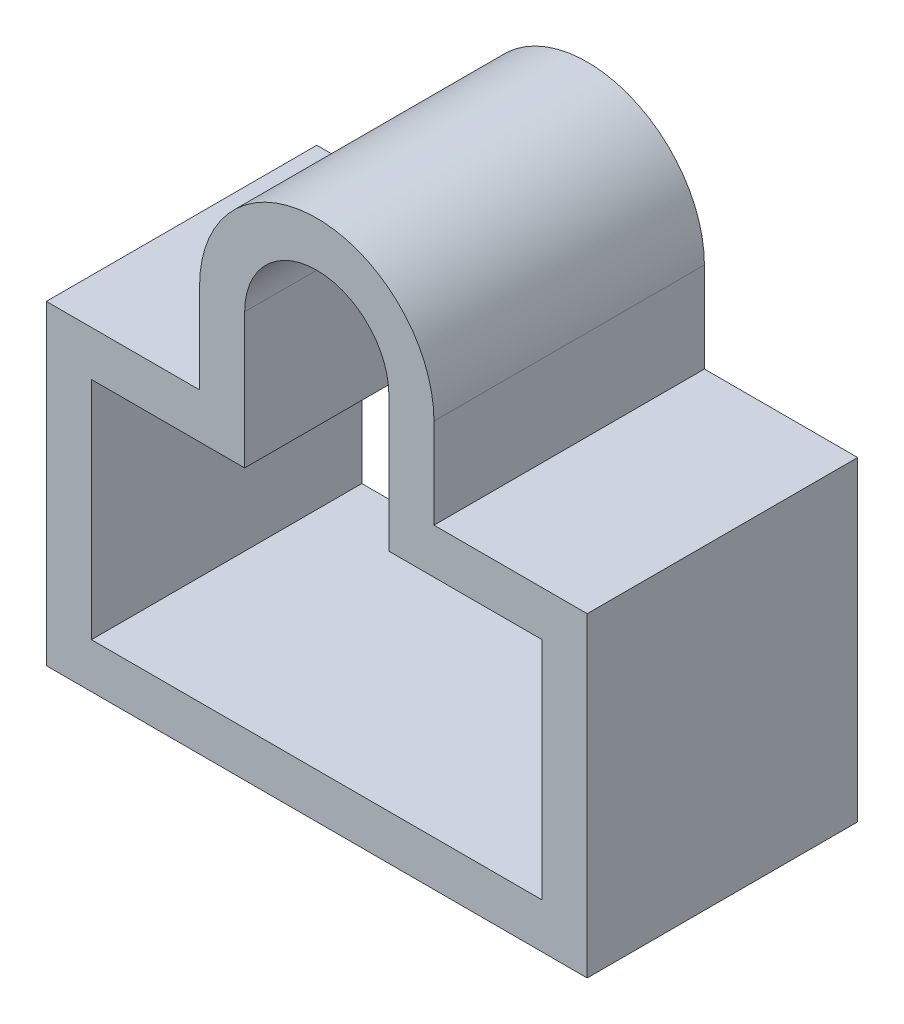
ISO-10303-21;
HEADER;
FILE_DESCRIPTION(('STEP AP214'),'2;1');
FILE_NAME('part.step','',(''),(''),'','','');
FILE_SCHEMA(('AUTOMOTIVE_DESIGN { 1 0 10303 214 1 1 1 1 }'));
ENDSEC;
DATA;
#1=APPLICATION_CONTEXT('core data for automotive mechanical design processes');
#2=APPLICATION_PROTOCOL_DEFINITION('international standard','automotive_design',2000,#1);
#3=PRODUCT_CONTEXT('',#1,'mechanical');
#4=PRODUCT('Part','Part','',(#3));
#5=PRODUCT_RELATED_PRODUCT_CATEGORY('part','',(#4));
#6=PRODUCT_DEFINITION_FORMATION('','',#4);
#7=PRODUCT_DEFINITION_CONTEXT('part definition',#1,'design');
#8=PRODUCT_DEFINITION('design','',#6,#7);
#9=PRODUCT_DEFINITION_SHAPE('','',#8);
#10=(LENGTH_UNIT() NAMED_UNIT(*) SI_UNIT(.MILLI.,.METRE.));
#11=(NAMED_UNIT(*) PLANE_ANGLE_UNIT() SI_UNIT($,.RADIAN.));
#12=(NAMED_UNIT(*) SI_UNIT($,.STERADIAN.) SOLID_ANGLE_UNIT());
#13=UNCERTAINTY_MEASURE_WITH_UNIT(LENGTH_MEASURE(1.E-05),#10,'distance_accuracy_value','');
#14=(GEOMETRIC_REPRESENTATION_CONTEXT(3) GLOBAL_UNCERTAINTY_ASSIGNED_CONTEXT((#13)) GLOBAL_UNIT_ASSIGNED_CONTEXT((#10,
#11,#12)) REPRESENTATION_CONTEXT('',''));
#15=CARTESIAN_POINT('',(0.,0.,0.));
#16=DIRECTION('',(0.,0.,1.));
#17=DIRECTION('',(1.,0.,0.));
#18=AXIS2_PLACEMENT_3D('',#15,#16,#17);
#19=CARTESIAN_POINT('',(30.,45.,30.));
#20=DIRECTION('',(0.,0.,1.));
#21=DIRECTION('',(1.,0.,0.));
#22=AXIS2_PLACEMENT_3D('',#19,#20,#21);
#23=PLANE('',#22);
#24=DIRECTION('',(0.,-1.,0.));
#25=VECTOR('',#24,1.);
#26=CARTESIAN_POINT('',(0.,35.,30.));
#27=LINE('',#26,#25);
#28=CARTESIAN_POINT('',(0.,35.,30.));
#29=VERTEX_POINT('',#28);
#30=CARTESIAN_POINT('',(0.,0.,30.));
#31=VERTEX_POINT('',#30);
#32=EDGE_CURVE('E256',#29,#31,#27,.T.);
#33=ORIENTED_EDGE('',*,*,#32,.T.);
#34=DIRECTION('',(1.,0.,0.));
#35=VECTOR('',#34,1.);
#36=CARTESIAN_POINT('',(0.,0.,30.));
#37=LINE('',#36,#35);
#38=CARTESIAN_POINT('',(60.,0.,30.));
#39=VERTEX_POINT('',#38);
#40=EDGE_CURVE('E259',#31,#39,#37,.T.);
#41=ORIENTED_EDGE('',*,*,#40,.T.);
#42=DIRECTION('',(0.,1.,0.));
#43=VECTOR('',#42,1.);
#44=CARTESIAN_POINT('',(60.,35.,30.));
#45=LINE('',#44,#43);
#46=CARTESIAN_POINT('',(60.,35.,30.));
#47=VERTEX_POINT('',#46);
#48=EDGE_CURVE('E262',#39,#47,#45,.T.);
#49=ORIENTED_EDGE('',*,*,#48,.T.);
#50=DIRECTION('',(-1.,0.,0.));
#51=VECTOR('',#50,1.);
#52=CARTESIAN_POINT('',(43.,35.,30.));
#53=LINE('',#52,#51);
#54=CARTESIAN_POINT('',(43.,35.,30.));
#55=VERTEX_POINT('',#54);
#56=EDGE_CURVE('E264',#47,#55,#53,.T.);
#57=ORIENTED_EDGE('',*,*,#56,.T.);
#58=DIRECTION('',(0.,1.,0.));
#59=VECTOR('',#58,1.);
#60=CARTESIAN_POINT('',(43.,45.,30.));
#61=LINE('',#60,#59);
#62=CARTESIAN_POINT('',(43.,45.,30.));
#63=VERTEX_POINT('',#62);
#64=EDGE_CURVE('E266',#55,#63,#61,.T.);
#65=ORIENTED_EDGE('',*,*,#64,.T.);
#66=CARTESIAN_POINT('',(30.,45.,30.));
#67=DIRECTION('',(0.,0.,1.));
#68=DIRECTION('',(1.,0.,0.));
#69=AXIS2_PLACEMENT_3D('',#66,#67,#68);
#70=CIRCLE('',#69,13.);
#71=CARTESIAN_POINT('',(17.,45.,30.));
#72=VERTEX_POINT('',#71);
#73=EDGE_CURVE('E268',#63,#72,#70,.T.);
#74=ORIENTED_EDGE('',*,*,#73,.T.);
#75=DIRECTION('',(0.,-1.,0.));
#76=VECTOR('',#75,1.);
#77=CARTESIAN_POINT('',(17.,35.,30.));
#78=LINE('',#77,#76);
#79=CARTESIAN_POINT('',(17.,35.,30.));
#80=VERTEX_POINT('',#79);
#81=EDGE_CURVE('E270',#72,#80,#78,.T.);
#82=ORIENTED_EDGE('',*,*,#81,.T.);
#83=DIRECTION('',(-1.,0.,0.));
#84=VECTOR('',#83,1.);
#85=CARTESIAN_POINT('',(0.,35.,30.));
#86=LINE('',#85,#84);
#87=EDGE_CURVE('E272',#80,#29,#86,.T.);
#88=ORIENTED_EDGE('',*,*,#87,.T.);
#89=EDGE_LOOP('',(#33,#41,#49,#57,#65,#74,#82,#88));
#90=FACE_BOUND('',#89,.T.);
#91=DIRECTION('',(1.,0.,0.));
#92=VECTOR('',#91,1.);
#93=CARTESIAN_POINT('',(0.,5.,30.));
#94=LINE('',#93,#92);
#95=CARTESIAN_POINT('',(5.,5.,30.));
#96=VERTEX_POINT('',#95);
#97=CARTESIAN_POINT('',(55.,5.,30.));
#98=VERTEX_POINT('',#97);
#99=EDGE_CURVE('E199',#96,#98,#94,.T.);
#100=ORIENTED_EDGE('',*,*,#99,.F.);
#101=DIRECTION('',(0.,-1.,0.));
#102=VECTOR('',#101,1.);
#103=CARTESIAN_POINT('',(5.,35.,30.));
#104=LINE('',#103,#102);
#105=CARTESIAN_POINT('',(5.,30.,30.));
#106=VERTEX_POINT('',#105);
#107=EDGE_CURVE('E191',#106,#96,#104,.T.);
#108=ORIENTED_EDGE('',*,*,#107,.F.);
#109=DIRECTION('',(-1.,0.,0.));
#110=VECTOR('',#109,1.);
#111=CARTESIAN_POINT('',(0.,30.,30.));
#112=LINE('',#111,#110);
#113=CARTESIAN_POINT('',(22.,30.,30.));
#114=VERTEX_POINT('',#113);
#115=EDGE_CURVE('E224',#114,#106,#112,.T.);
#116=ORIENTED_EDGE('',*,*,#115,.F.);
#117=DIRECTION('',(0.,-1.,0.));
#118=VECTOR('',#117,1.);
#119=CARTESIAN_POINT('',(22.,35.,30.));
#120=LINE('',#119,#118);
#121=CARTESIAN_POINT('',(22.,45.,30.));
#122=VERTEX_POINT('',#121);
#123=EDGE_CURVE('E222',#122,#114,#120,.T.);
#124=ORIENTED_EDGE('',*,*,#123,.F.);
#125=CARTESIAN_POINT('',(30.,45.,30.));
#126=DIRECTION('',(0.,0.,1.));
#127=DIRECTION('',(1.,0.,0.));
#128=AXIS2_PLACEMENT_3D('',#125,#126,#127);
#129=CIRCLE('',#128,8.);
#130=CARTESIAN_POINT('',(38.,45.,30.));
#131=VERTEX_POINT('',#130);
#132=EDGE_CURVE('E220',#131,#122,#129,.T.);
#133=ORIENTED_EDGE('',*,*,#132,.F.);
#134=DIRECTION('',(0.,1.,0.));
#135=VECTOR('',#134,1.);
#136=CARTESIAN_POINT('',(38.,45.,30.));
#137=LINE('',#136,#135);
#138=CARTESIAN_POINT('',(38.,30.,30.));
#139=VERTEX_POINT('',#138);
#140=EDGE_CURVE('E218',#139,#131,#137,.T.);
#141=ORIENTED_EDGE('',*,*,#140,.F.);
#142=DIRECTION('',(-1.,0.,0.));
#143=VECTOR('',#142,1.);
#144=CARTESIAN_POINT('',(43.,30.,30.));
#145=LINE('',#144,#143);
#146=CARTESIAN_POINT('',(55.,30.,30.));
#147=VERTEX_POINT('',#146);
#148=EDGE_CURVE('E214',#147,#139,#145,.T.);
#149=ORIENTED_EDGE('',*,*,#148,.F.);
#150=DIRECTION('',(0.,1.,0.));
#151=VECTOR('',#150,1.);
#152=CARTESIAN_POINT('',(55.,35.,30.));
#153=LINE('',#152,#151);
#154=EDGE_CURVE('E212',#98,#147,#153,.T.);
#155=ORIENTED_EDGE('',*,*,#154,.F.);
#156=EDGE_LOOP('',(#100,#108,#116,#124,#133,#141,#149,#155));
#157=FACE_BOUND('',#156,.T.);
#158=ADVANCED_FACE('F78',(#90,#157),#23,.T.);
#159=CARTESIAN_POINT('',(30.,45.,0.));
#160=DIRECTION('',(0.,0.,1.));
#161=DIRECTION('',(1.,0.,0.));
#162=AXIS2_PLACEMENT_3D('',#159,#160,#161);
#163=PLANE('',#162);
#164=DIRECTION('',(0.,-1.,0.));
#165=VECTOR('',#164,1.);
#166=CARTESIAN_POINT('',(0.,35.,0.));
#167=LINE('',#166,#165);
#168=CARTESIAN_POINT('',(0.,35.,0.));
#169=VERTEX_POINT('',#168);
#170=CARTESIAN_POINT('',(0.,0.,0.));
#171=VERTEX_POINT('',#170);
#172=EDGE_CURVE('E207',#169,#171,#167,.T.);
#173=ORIENTED_EDGE('',*,*,#172,.F.);
#174=DIRECTION('',(-1.,0.,0.));
#175=VECTOR('',#174,1.);
#176=CARTESIAN_POINT('',(0.,35.,0.));
#177=LINE('',#176,#175);
#178=CARTESIAN_POINT('',(17.,35.,0.));
#179=VERTEX_POINT('',#178);
#180=EDGE_CURVE('E260',#179,#169,#177,.T.);
#181=ORIENTED_EDGE('',*,*,#180,.F.);
#182=DIRECTION('',(0.,-1.,0.));
#183=VECTOR('',#182,1.);
#184=CARTESIAN_POINT('',(17.,35.,0.));
#185=LINE('',#184,#183);
#186=CARTESIAN_POINT('',(17.,45.,0.));
#187=VERTEX_POINT('',#186);
#188=EDGE_CURVE('E287',#187,#179,#185,.T.);
#189=ORIENTED_EDGE('',*,*,#188,.F.);
#190=CARTESIAN_POINT('',(30.,45.,0.));
#191=DIRECTION('',(0.,0.,1.));
#192=DIRECTION('',(1.,0.,0.));
#193=AXIS2_PLACEMENT_3D('',#190,#191,#192);
#194=CIRCLE('',#193,13.);
#195=CARTESIAN_POINT('',(43.,45.,0.));
#196=VERTEX_POINT('',#195);
#197=EDGE_CURVE('E285',#196,#187,#194,.T.);
#198=ORIENTED_EDGE('',*,*,#197,.F.);
#199=DIRECTION('',(0.,1.,0.));
#200=VECTOR('',#199,1.);
#201=CARTESIAN_POINT('',(43.,45.,0.));
#202=LINE('',#201,#200);
#203=CARTESIAN_POINT('',(43.,35.,0.));
#204=VERTEX_POINT('',#203);
#205=EDGE_CURVE('E283',#204,#196,#202,.T.);
#206=ORIENTED_EDGE('',*,*,#205,.F.);
#207=DIRECTION('',(-1.,0.,0.));
#208=VECTOR('',#207,1.);
#209=CARTESIAN_POINT('',(43.,35.,0.));
#210=LINE('',#209,#208);
#211=CARTESIAN_POINT('',(60.,35.,0.));
#212=VERTEX_POINT('',#211);
#213=EDGE_CURVE('E281',#212,#204,#210,.T.);
#214=ORIENTED_EDGE('',*,*,#213,.F.);
#215=DIRECTION('',(0.,1.,0.));
#216=VECTOR('',#215,1.);
#217=CARTESIAN_POINT('',(60.,35.,0.));
#218=LINE('',#217,#216);
#219=CARTESIAN_POINT('',(60.,0.,0.));
#220=VERTEX_POINT('',#219);
#221=EDGE_CURVE('E279',#220,#212,#218,.T.);
#222=ORIENTED_EDGE('',*,*,#221,.F.);
#223=DIRECTION('',(1.,0.,0.));
#224=VECTOR('',#223,1.);
#225=CARTESIAN_POINT('',(0.,0.,0.));
#226=LINE('',#225,#224);
#227=EDGE_CURVE('E277',#171,#220,#226,.T.);
#228=ORIENTED_EDGE('',*,*,#227,.F.);
#229=EDGE_LOOP('',(#173,#181,#189,#198,#206,#214,#222,#228));
#230=FACE_BOUND('',#229,.T.);
#231=DIRECTION('',(0.,-1.,0.));
#232=VECTOR('',#231,1.);
#233=CARTESIAN_POINT('',(5.,35.,0.));
#234=LINE('',#233,#232);
#235=CARTESIAN_POINT('',(5.,30.,0.));
#236=VERTEX_POINT('',#235);
#237=CARTESIAN_POINT('',(5.,5.,0.));
#238=VERTEX_POINT('',#237);
#239=EDGE_CURVE('E101',#236,#238,#234,.T.);
#240=ORIENTED_EDGE('',*,*,#239,.T.);
#241=DIRECTION('',(1.,0.,0.));
#242=VECTOR('',#241,1.);
#243=CARTESIAN_POINT('',(0.,5.,0.));
#244=LINE('',#243,#242);
#245=CARTESIAN_POINT('',(55.,5.,0.));
#246=VERTEX_POINT('',#245);
#247=EDGE_CURVE('E206',#238,#246,#244,.T.);
#248=ORIENTED_EDGE('',*,*,#247,.T.);
#249=DIRECTION('',(0.,1.,0.));
#250=VECTOR('',#249,1.);
#251=CARTESIAN_POINT('',(55.,35.,0.));
#252=LINE('',#251,#250);
#253=CARTESIAN_POINT('',(55.,30.,0.));
#254=VERTEX_POINT('',#253);
#255=EDGE_CURVE('E228',#246,#254,#252,.T.);
#256=ORIENTED_EDGE('',*,*,#255,.T.);
#257=DIRECTION('',(-1.,0.,0.));
#258=VECTOR('',#257,1.);
#259=CARTESIAN_POINT('',(43.,30.,0.));
#260=LINE('',#259,#258);
#261=CARTESIAN_POINT('',(38.,30.,0.));
#262=VERTEX_POINT('',#261);
#263=EDGE_CURVE('E231',#254,#262,#260,.T.);
#264=ORIENTED_EDGE('',*,*,#263,.T.);
#265=DIRECTION('',(0.,1.,0.));
#266=VECTOR('',#265,1.);
#267=CARTESIAN_POINT('',(38.,45.,0.));
#268=LINE('',#267,#266);
#269=CARTESIAN_POINT('',(38.,45.,0.));
#270=VERTEX_POINT('',#269);
#271=EDGE_CURVE('E234',#262,#270,#268,.T.);
#272=ORIENTED_EDGE('',*,*,#271,.T.);
#273=CARTESIAN_POINT('',(30.,45.,0.));
#274=DIRECTION('',(0.,0.,1.));
#275=DIRECTION('',(1.,0.,0.));
#276=AXIS2_PLACEMENT_3D('',#273,#274,#275);
#277=CIRCLE('',#276,8.);
#278=CARTESIAN_POINT('',(22.,45.,0.));
#279=VERTEX_POINT('',#278);
#280=EDGE_CURVE('E237',#270,#279,#277,.T.);
#281=ORIENTED_EDGE('',*,*,#280,.T.);
#282=DIRECTION('',(0.,-1.,0.));
#283=VECTOR('',#282,1.);
#284=CARTESIAN_POINT('',(22.,35.,0.));
#285=LINE('',#284,#283);
#286=CARTESIAN_POINT('',(22.,30.,0.));
#287=VERTEX_POINT('',#286);
#288=EDGE_CURVE('E240',#279,#287,#285,.T.);
#289=ORIENTED_EDGE('',*,*,#288,.T.);
#290=DIRECTION('',(-1.,0.,0.));
#291=VECTOR('',#290,1.);
#292=CARTESIAN_POINT('',(0.,30.,0.));
#293=LINE('',#292,#291);
#294=EDGE_CURVE('E200',#287,#236,#293,.T.);
#295=ORIENTED_EDGE('',*,*,#294,.T.);
#296=EDGE_LOOP('',(#240,#248,#256,#264,#272,#281,#289,#295));
#297=FACE_BOUND('',#296,.T.);
#298=ADVANCED_FACE('F317',(#230,#297),#163,.F.);
#299=CARTESIAN_POINT('',(0.,35.,30.));
#300=DIRECTION('',(1.,0.,0.));
#301=DIRECTION('',(0.,1.,0.));
#302=AXIS2_PLACEMENT_3D('',#299,#300,#301);
#303=PLANE('',#302);
#304=ORIENTED_EDGE('',*,*,#172,.T.);
#305=DIRECTION('',(0.,0.,-1.));
#306=VECTOR('',#305,1.);
#307=CARTESIAN_POINT('',(0.,0.,30.));
#308=LINE('',#307,#306);
#309=EDGE_CURVE('E12',#31,#171,#308,.T.);
#310=ORIENTED_EDGE('',*,*,#309,.F.);
#311=ORIENTED_EDGE('',*,*,#32,.F.);
#312=DIRECTION('',(0.,0.,-1.));
#313=VECTOR('',#312,1.);
#314=CARTESIAN_POINT('',(0.,35.,30.));
#315=LINE('',#314,#313);
#316=EDGE_CURVE('E274',#29,#169,#315,.T.);
#317=ORIENTED_EDGE('',*,*,#316,.T.);
#318=EDGE_LOOP('',(#304,#310,#311,#317));
#319=FACE_BOUND('',#318,.T.);
#320=ADVANCED_FACE('F80',(#319),#303,.F.);
#321=CARTESIAN_POINT('',(0.,0.,30.));
#322=DIRECTION('',(0.,1.,0.));
#323=DIRECTION('',(0.,0.,1.));
#324=AXIS2_PLACEMENT_3D('',#321,#322,#323);
#325=PLANE('',#324);
#326=ORIENTED_EDGE('',*,*,#227,.T.);
#327=DIRECTION('',(0.,0.,-1.));
#328=VECTOR('',#327,1.);
#329=CARTESIAN_POINT('',(60.,0.,30.));
#330=LINE('',#329,#328);
#331=EDGE_CURVE('E86',#39,#220,#330,.T.);
#332=ORIENTED_EDGE('',*,*,#331,.F.);
#333=ORIENTED_EDGE('',*,*,#40,.F.);
#334=ORIENTED_EDGE('',*,*,#309,.T.);
#335=EDGE_LOOP('',(#326,#332,#333,#334));
#336=FACE_BOUND('',#335,.T.);
#337=ADVANCED_FACE('F334',(#336),#325,.F.);
#338=CARTESIAN_POINT('',(60.,35.,30.));
#339=DIRECTION('',(-1.,0.,0.));
#340=DIRECTION('',(0.,-1.,0.));
#341=AXIS2_PLACEMENT_3D('',#338,#339,#340);
#342=PLANE('',#341);
#343=ORIENTED_EDGE('',*,*,#221,.T.);
#344=DIRECTION('',(0.,0.,-1.));
#345=VECTOR('',#344,1.);
#346=CARTESIAN_POINT('',(60.,35.,30.));
#347=LINE('',#346,#345);
#348=EDGE_CURVE('E304',#47,#212,#347,.T.);
#349=ORIENTED_EDGE('',*,*,#348,.F.);
#350=ORIENTED_EDGE('',*,*,#48,.F.);
#351=ORIENTED_EDGE('',*,*,#331,.T.);
#352=EDGE_LOOP('',(#343,#349,#350,#351));
#353=FACE_BOUND('',#352,.T.);
#354=ADVANCED_FACE('F311',(#353),#342,.F.);
#355=CARTESIAN_POINT('',(43.,35.,30.));
#356=DIRECTION('',(0.,-1.,0.));
#357=DIRECTION('',(0.,0.,-1.));
#358=AXIS2_PLACEMENT_3D('',#355,#356,#357);
#359=PLANE('',#358);
#360=ORIENTED_EDGE('',*,*,#213,.T.);
#361=DIRECTION('',(0.,0.,-1.));
#362=VECTOR('',#361,1.);
#363=CARTESIAN_POINT('',(43.,35.,30.));
#364=LINE('',#363,#362);
#365=EDGE_CURVE('E301',#55,#204,#364,.T.);
#366=ORIENTED_EDGE('',*,*,#365,.F.);
#367=ORIENTED_EDGE('',*,*,#56,.F.);
#368=ORIENTED_EDGE('',*,*,#348,.T.);
#369=EDGE_LOOP('',(#360,#366,#367,#368));
#370=FACE_BOUND('',#369,.T.);
#371=ADVANCED_FACE('F323',(#370),#359,.F.);
#372=CARTESIAN_POINT('',(43.,45.,30.));
#373=DIRECTION('',(-1.,0.,0.));
#374=DIRECTION('',(0.,-1.,0.));
#375=AXIS2_PLACEMENT_3D('',#372,#373,#374);
#376=PLANE('',#375);
#377=ORIENTED_EDGE('',*,*,#205,.T.);
#378=DIRECTION('',(0.,0.,-1.));
#379=VECTOR('',#378,1.);
#380=CARTESIAN_POINT('',(43.,45.,30.));
#381=LINE('',#380,#379);
#382=EDGE_CURVE('E298',#63,#196,#381,.T.);
#383=ORIENTED_EDGE('',*,*,#382,.F.);
#384=ORIENTED_EDGE('',*,*,#64,.F.);
#385=ORIENTED_EDGE('',*,*,#365,.T.);
#386=EDGE_LOOP('',(#377,#383,#384,#385));
#387=FACE_BOUND('',#386,.T.);
#388=ADVANCED_FACE('F327',(#387),#376,.F.);
#389=CARTESIAN_POINT('',(30.,45.,30.));
#390=DIRECTION('',(0.,0.,-1.));
#391=DIRECTION('',(-1.,0.,0.));
#392=AXIS2_PLACEMENT_3D('',#389,#390,#391);
#393=CYLINDRICAL_SURFACE('',#392,13.);
#394=ORIENTED_EDGE('',*,*,#197,.T.);
#395=DIRECTION('',(0.,0.,-1.));
#396=VECTOR('',#395,1.);
#397=CARTESIAN_POINT('',(17.,45.,30.));
#398=LINE('',#397,#396);
#399=EDGE_CURVE('E295',#72,#187,#398,.T.);
#400=ORIENTED_EDGE('',*,*,#399,.F.);
#401=ORIENTED_EDGE('',*,*,#73,.F.);
#402=ORIENTED_EDGE('',*,*,#382,.T.);
#403=EDGE_LOOP('',(#394,#400,#401,#402));
#404=FACE_BOUND('',#403,.T.);
#405=ADVANCED_FACE('F347',(#404),#393,.T.);
#406=CARTESIAN_POINT('',(17.,35.,30.));
#407=DIRECTION('',(1.,0.,0.));
#408=DIRECTION('',(0.,0.,-1.));
#409=AXIS2_PLACEMENT_3D('',#406,#407,#408);
#410=PLANE('',#409);
#411=ORIENTED_EDGE('',*,*,#188,.T.);
#412=DIRECTION('',(0.,0.,-1.));
#413=VECTOR('',#412,1.);
#414=CARTESIAN_POINT('',(17.,35.,30.));
#415=LINE('',#414,#413);
#416=EDGE_CURVE('E292',#80,#179,#415,.T.);
#417=ORIENTED_EDGE('',*,*,#416,.F.);
#418=ORIENTED_EDGE('',*,*,#81,.F.);
#419=ORIENTED_EDGE('',*,*,#399,.T.);
#420=EDGE_LOOP('',(#411,#417,#418,#419));
#421=FACE_BOUND('',#420,.T.);
#422=ADVANCED_FACE('F345',(#421),#410,.F.);
#423=CARTESIAN_POINT('',(0.,35.,30.));
#424=DIRECTION('',(0.,-1.,0.));
#425=DIRECTION('',(0.,0.,-1.));
#426=AXIS2_PLACEMENT_3D('',#423,#424,#425);
#427=PLANE('',#426);
#428=ORIENTED_EDGE('',*,*,#180,.T.);
#429=ORIENTED_EDGE('',*,*,#316,.F.);
#430=ORIENTED_EDGE('',*,*,#87,.F.);
#431=ORIENTED_EDGE('',*,*,#416,.T.);
#432=EDGE_LOOP('',(#428,#429,#430,#431));
#433=FACE_BOUND('',#432,.T.);
#434=ADVANCED_FACE('F340',(#433),#427,.F.);
#435=CARTESIAN_POINT('',(5.,35.,30.));
#436=DIRECTION('',(1.,0.,0.));
#437=DIRECTION('',(0.,1.,0.));
#438=AXIS2_PLACEMENT_3D('',#435,#436,#437);
#439=PLANE('',#438);
#440=ORIENTED_EDGE('',*,*,#239,.F.);
#441=DIRECTION('',(0.,0.,-1.));
#442=VECTOR('',#441,1.);
#443=CARTESIAN_POINT('',(5.,30.,30.));
#444=LINE('',#443,#442);
#445=EDGE_CURVE('E195',#106,#236,#444,.T.);
#446=ORIENTED_EDGE('',*,*,#445,.F.);
#447=ORIENTED_EDGE('',*,*,#107,.T.);
#448=DIRECTION('',(0.,0.,-1.));
#449=VECTOR('',#448,1.);
#450=CARTESIAN_POINT('',(5.,5.,30.));
#451=LINE('',#450,#449);
#452=EDGE_CURVE('E194',#96,#238,#451,.T.);
#453=ORIENTED_EDGE('',*,*,#452,.T.);
#454=EDGE_LOOP('',(#440,#446,#447,#453));
#455=FACE_BOUND('',#454,.T.);
#456=ADVANCED_FACE('F193',(#455),#439,.T.);
#457=CARTESIAN_POINT('',(0.,5.,30.));
#458=DIRECTION('',(0.,1.,0.));
#459=DIRECTION('',(0.,0.,1.));
#460=AXIS2_PLACEMENT_3D('',#457,#458,#459);
#461=PLANE('',#460);
#462=ORIENTED_EDGE('',*,*,#247,.F.);
#463=ORIENTED_EDGE('',*,*,#452,.F.);
#464=ORIENTED_EDGE('',*,*,#99,.T.);
#465=DIRECTION('',(0.,0.,-1.));
#466=VECTOR('',#465,1.);
#467=CARTESIAN_POINT('',(55.,5.,30.));
#468=LINE('',#467,#466);
#469=EDGE_CURVE('E208',#98,#246,#468,.T.);
#470=ORIENTED_EDGE('',*,*,#469,.T.);
#471=EDGE_LOOP('',(#462,#463,#464,#470));
#472=FACE_BOUND('',#471,.T.);
#473=ADVANCED_FACE('F203',(#472),#461,.T.);
#474=CARTESIAN_POINT('',(55.,35.,30.));
#475=DIRECTION('',(-1.,0.,0.));
#476=DIRECTION('',(0.,-1.,0.));
#477=AXIS2_PLACEMENT_3D('',#474,#475,#476);
#478=PLANE('',#477);
#479=ORIENTED_EDGE('',*,*,#255,.F.);
#480=ORIENTED_EDGE('',*,*,#469,.F.);
#481=ORIENTED_EDGE('',*,*,#154,.T.);
#482=DIRECTION('',(0.,0.,-1.));
#483=VECTOR('',#482,1.);
#484=CARTESIAN_POINT('',(55.,30.,30.));
#485=LINE('',#484,#483);
#486=EDGE_CURVE('E253',#147,#254,#485,.T.);
#487=ORIENTED_EDGE('',*,*,#486,.T.);
#488=EDGE_LOOP('',(#479,#480,#481,#487));
#489=FACE_BOUND('',#488,.T.);
#490=ADVANCED_FACE('F372',(#489),#478,.T.);
#491=CARTESIAN_POINT('',(43.,30.,30.));
#492=DIRECTION('',(0.,-1.,0.));
#493=DIRECTION('',(0.,0.,-1.));
#494=AXIS2_PLACEMENT_3D('',#491,#492,#493);
#495=PLANE('',#494);
#496=ORIENTED_EDGE('',*,*,#263,.F.);
#497=ORIENTED_EDGE('',*,*,#486,.F.);
#498=ORIENTED_EDGE('',*,*,#148,.T.);
#499=DIRECTION('',(0.,0.,-1.));
#500=VECTOR('',#499,1.);
#501=CARTESIAN_POINT('',(38.,30.,30.));
#502=LINE('',#501,#500);
#503=EDGE_CURVE('E251',#139,#262,#502,.T.);
#504=ORIENTED_EDGE('',*,*,#503,.T.);
#505=EDGE_LOOP('',(#496,#497,#498,#504));
#506=FACE_BOUND('',#505,.T.);
#507=ADVANCED_FACE('F376',(#506),#495,.T.);
#508=CARTESIAN_POINT('',(38.,45.,30.));
#509=DIRECTION('',(-1.,0.,0.));
#510=DIRECTION('',(0.,-1.,0.));
#511=AXIS2_PLACEMENT_3D('',#508,#509,#510);
#512=PLANE('',#511);
#513=ORIENTED_EDGE('',*,*,#271,.F.);
#514=ORIENTED_EDGE('',*,*,#503,.F.);
#515=ORIENTED_EDGE('',*,*,#140,.T.);
#516=DIRECTION('',(0.,0.,-1.));
#517=VECTOR('',#516,1.);
#518=CARTESIAN_POINT('',(38.,45.,30.));
#519=LINE('',#518,#517);
#520=EDGE_CURVE('E249',#131,#270,#519,.T.);
#521=ORIENTED_EDGE('',*,*,#520,.T.);
#522=EDGE_LOOP('',(#513,#514,#515,#521));
#523=FACE_BOUND('',#522,.T.);
#524=ADVANCED_FACE('F382',(#523),#512,.T.);
#525=CARTESIAN_POINT('',(30.,45.,30.));
#526=DIRECTION('',(0.,0.,-1.));
#527=DIRECTION('',(-1.,0.,0.));
#528=AXIS2_PLACEMENT_3D('',#525,#526,#527);
#529=CYLINDRICAL_SURFACE('',#528,8.);
#530=ORIENTED_EDGE('',*,*,#280,.F.);
#531=ORIENTED_EDGE('',*,*,#520,.F.);
#532=ORIENTED_EDGE('',*,*,#132,.T.);
#533=DIRECTION('',(0.,0.,-1.));
#534=VECTOR('',#533,1.);
#535=CARTESIAN_POINT('',(22.,45.,30.));
#536=LINE('',#535,#534);
#537=EDGE_CURVE('E247',#122,#279,#536,.T.);
#538=ORIENTED_EDGE('',*,*,#537,.T.);
#539=EDGE_LOOP('',(#530,#531,#532,#538));
#540=FACE_BOUND('',#539,.T.);
#541=ADVANCED_FACE('F386',(#540),#529,.F.);
#542=CARTESIAN_POINT('',(22.,35.,30.));
#543=DIRECTION('',(1.,0.,0.));
#544=DIRECTION('',(0.,0.,-1.));
#545=AXIS2_PLACEMENT_3D('',#542,#543,#544);
#546=PLANE('',#545);
#547=ORIENTED_EDGE('',*,*,#288,.F.);
#548=ORIENTED_EDGE('',*,*,#537,.F.);
#549=ORIENTED_EDGE('',*,*,#123,.T.);
#550=DIRECTION('',(0.,0.,-1.));
#551=VECTOR('',#550,1.);
#552=CARTESIAN_POINT('',(22.,30.,30.));
#553=LINE('',#552,#551);
#554=EDGE_CURVE('E93',#114,#287,#553,.T.);
#555=ORIENTED_EDGE('',*,*,#554,.T.);
#556=EDGE_LOOP('',(#547,#548,#549,#555));
#557=FACE_BOUND('',#556,.T.);
#558=ADVANCED_FACE('F390',(#557),#546,.T.);
#559=CARTESIAN_POINT('',(0.,30.,30.));
#560=DIRECTION('',(0.,-1.,0.));
#561=DIRECTION('',(0.,0.,-1.));
#562=AXIS2_PLACEMENT_3D('',#559,#560,#561);
#563=PLANE('',#562);
#564=ORIENTED_EDGE('',*,*,#294,.F.);
#565=ORIENTED_EDGE('',*,*,#554,.F.);
#566=ORIENTED_EDGE('',*,*,#115,.T.);
#567=ORIENTED_EDGE('',*,*,#445,.T.);
#568=EDGE_LOOP('',(#564,#565,#566,#567));
#569=FACE_BOUND('',#568,.T.);
#570=ADVANCED_FACE('F394',(#569),#563,.T.);
#571=CLOSED_SHELL('',(#158,#298,#320,#337,#354,#371,#388,#405,#422,#434,#456,#473,#490,#507,
#524,#541,#558,#570));
#572=MANIFOLD_SOLID_BREP('B2',#571);
#573=ADVANCED_BREP_SHAPE_REPRESENTATION('',(#18,#572),#14);
#574=SHAPE_DEFINITION_REPRESENTATION(#9,#573);
ENDSEC;
END-ISO-10303-21;
